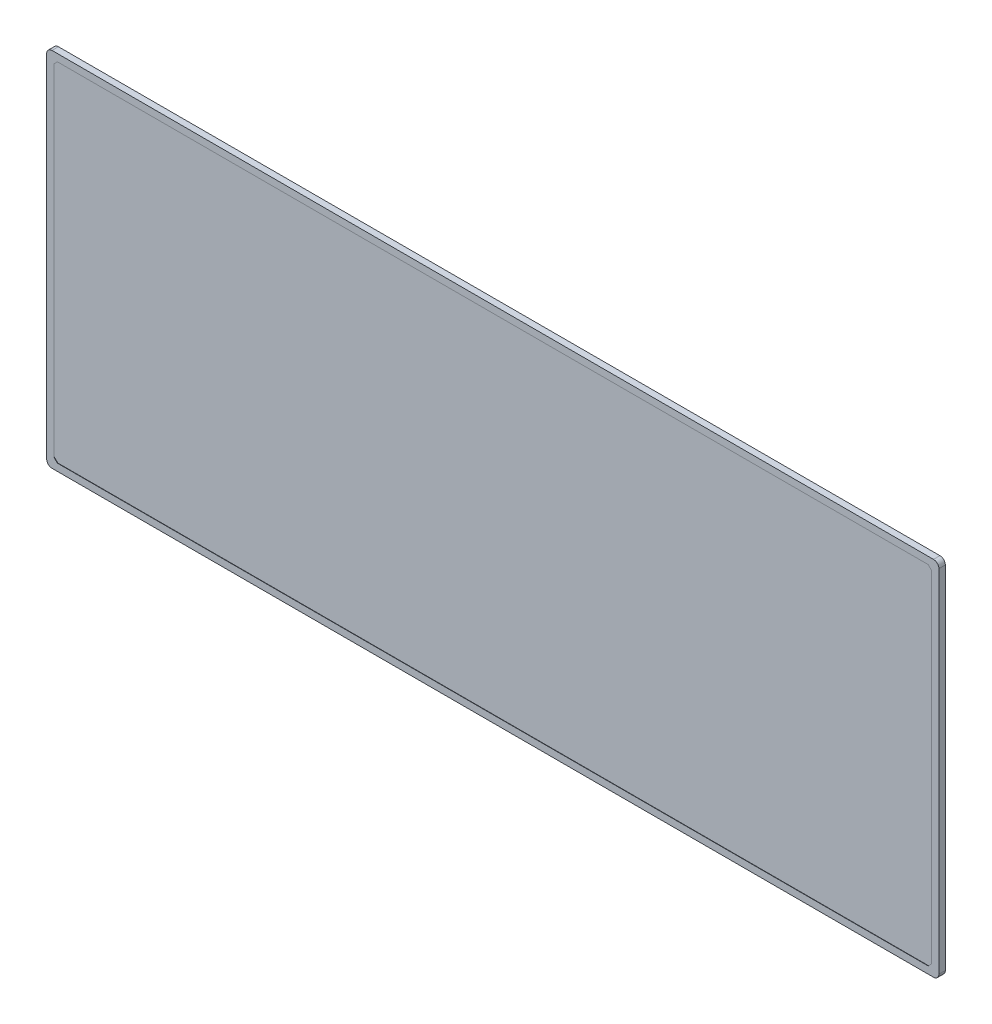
ISO-10303-21;
HEADER;
FILE_DESCRIPTION(('STEP AP214'),'2;1');
FILE_NAME('part.step','',(''),(''),'','','');
FILE_SCHEMA(('AUTOMOTIVE_DESIGN { 1 0 10303 214 1 1 1 1 }'));
ENDSEC;
DATA;
#1=APPLICATION_CONTEXT('core data for automotive mechanical design processes');
#2=APPLICATION_PROTOCOL_DEFINITION('international standard','automotive_design',2000,#1);
#3=PRODUCT_CONTEXT('',#1,'mechanical');
#4=PRODUCT('Part','Part','',(#3));
#5=PRODUCT_RELATED_PRODUCT_CATEGORY('part','',(#4));
#6=PRODUCT_DEFINITION_FORMATION('','',#4);
#7=PRODUCT_DEFINITION_CONTEXT('part definition',#1,'design');
#8=PRODUCT_DEFINITION('design','',#6,#7);
#9=PRODUCT_DEFINITION_SHAPE('','',#8);
#10=(LENGTH_UNIT() NAMED_UNIT(*) SI_UNIT(.MILLI.,.METRE.));
#11=(NAMED_UNIT(*) PLANE_ANGLE_UNIT() SI_UNIT($,.RADIAN.));
#12=(NAMED_UNIT(*) SI_UNIT($,.STERADIAN.) SOLID_ANGLE_UNIT());
#13=UNCERTAINTY_MEASURE_WITH_UNIT(LENGTH_MEASURE(1.E-05),#10,'distance_accuracy_value','');
#14=(GEOMETRIC_REPRESENTATION_CONTEXT(3) GLOBAL_UNCERTAINTY_ASSIGNED_CONTEXT((#13)) GLOBAL_UNIT_ASSIGNED_CONTEXT((#10,
#11,#12)) REPRESENTATION_CONTEXT('',''));
#15=CARTESIAN_POINT('',(0.,0.,0.));
#16=DIRECTION('',(0.,0.,1.));
#17=DIRECTION('',(1.,0.,0.));
#18=AXIS2_PLACEMENT_3D('',#15,#16,#17);
#19=CARTESIAN_POINT('',(0.,0.,17.));
#20=DIRECTION('',(0.,0.,-1.));
#21=DIRECTION('',(-1.,0.,0.));
#22=AXIS2_PLACEMENT_3D('',#19,#20,#21);
#23=PLANE('',#22);
#24=DIRECTION('',(0.,1.,0.));
#25=VECTOR('',#24,1.);
#26=CARTESIAN_POINT('',(1227.5,-486.,17.));
#27=LINE('',#26,#25);
#28=CARTESIAN_POINT('',(1227.5,-476.,17.));
#29=VERTEX_POINT('',#28);
#30=CARTESIAN_POINT('',(1227.5,476.,17.));
#31=VERTEX_POINT('',#30);
#32=EDGE_CURVE('E264',#29,#31,#27,.T.);
#33=ORIENTED_EDGE('',*,*,#32,.T.);
#34=DIRECTION('',(0.70710678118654,-0.707106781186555,0.));
#35=VECTOR('',#34,1.);
#36=CARTESIAN_POINT('',(1227.5,476.,17.));
#37=LINE('',#36,#35);
#38=CARTESIAN_POINT('',(1217.5,486.,17.));
#39=VERTEX_POINT('',#38);
#40=EDGE_CURVE('E219',#31,#39,#37,.F.);
#41=ORIENTED_EDGE('',*,*,#40,.T.);
#42=DIRECTION('',(-1.,0.,0.));
#43=VECTOR('',#42,1.);
#44=CARTESIAN_POINT('',(-1227.5,486.,17.));
#45=LINE('',#44,#43);
#46=CARTESIAN_POINT('',(-1217.5,486.,17.));
#47=VERTEX_POINT('',#46);
#48=EDGE_CURVE('E269',#39,#47,#45,.T.);
#49=ORIENTED_EDGE('',*,*,#48,.T.);
#50=DIRECTION('',(0.707106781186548,0.707106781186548,0.));
#51=VECTOR('',#50,1.);
#52=CARTESIAN_POINT('',(-1217.5,486.,17.));
#53=LINE('',#52,#51);
#54=CARTESIAN_POINT('',(-1227.5,476.,17.));
#55=VERTEX_POINT('',#54);
#56=EDGE_CURVE('E217',#47,#55,#53,.F.);
#57=ORIENTED_EDGE('',*,*,#56,.T.);
#58=DIRECTION('',(0.,-1.,0.));
#59=VECTOR('',#58,1.);
#60=CARTESIAN_POINT('',(-1227.5,-486.,17.));
#61=LINE('',#60,#59);
#62=CARTESIAN_POINT('',(-1227.5,-476.,17.));
#63=VERTEX_POINT('',#62);
#64=EDGE_CURVE('E180',#55,#63,#61,.T.);
#65=ORIENTED_EDGE('',*,*,#64,.T.);
#66=DIRECTION('',(-0.70710678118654,0.707106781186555,0.));
#67=VECTOR('',#66,1.);
#68=CARTESIAN_POINT('',(-1227.5,-476.,17.));
#69=LINE('',#68,#67);
#70=CARTESIAN_POINT('',(-1217.5,-486.,17.));
#71=VERTEX_POINT('',#70);
#72=EDGE_CURVE('E215',#63,#71,#69,.F.);
#73=ORIENTED_EDGE('',*,*,#72,.T.);
#74=DIRECTION('',(1.,0.,0.));
#75=VECTOR('',#74,1.);
#76=CARTESIAN_POINT('',(-1227.5,-486.,17.));
#77=LINE('',#76,#75);
#78=CARTESIAN_POINT('',(1217.5,-486.,17.));
#79=VERTEX_POINT('',#78);
#80=EDGE_CURVE('E175',#71,#79,#77,.T.);
#81=ORIENTED_EDGE('',*,*,#80,.T.);
#82=DIRECTION('',(-0.707106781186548,-0.707106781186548,0.));
#83=VECTOR('',#82,1.);
#84=CARTESIAN_POINT('',(1217.5,-486.,17.));
#85=LINE('',#84,#83);
#86=EDGE_CURVE('E213',#79,#29,#85,.F.);
#87=ORIENTED_EDGE('',*,*,#86,.T.);
#88=EDGE_LOOP('',(#33,#41,#49,#57,#65,#73,#81,#87));
#89=FACE_BOUND('',#88,.T.);
#90=ADVANCED_FACE('F35',(#89),#23,.F.);
#91=CARTESIAN_POINT('',(1227.5,-486.,18.));
#92=DIRECTION('',(0.,-1.,0.));
#93=DIRECTION('',(0.,0.,-1.));
#94=AXIS2_PLACEMENT_3D('',#91,#92,#93);
#95=PLANE('',#94);
#96=ORIENTED_EDGE('',*,*,#80,.F.);
#97=DIRECTION('',(0.,0.,1.));
#98=VECTOR('',#97,1.);
#99=CARTESIAN_POINT('',(-1217.5,-486.,18.));
#100=LINE('',#99,#98);
#101=CARTESIAN_POINT('',(-1217.5,-486.,18.));
#102=VERTEX_POINT('',#101);
#103=EDGE_CURVE('E50',#71,#102,#100,.T.);
#104=ORIENTED_EDGE('',*,*,#103,.T.);
#105=DIRECTION('',(-1.,0.,0.));
#106=VECTOR('',#105,1.);
#107=CARTESIAN_POINT('',(1227.5,-486.,18.));
#108=LINE('',#107,#106);
#109=CARTESIAN_POINT('',(1217.5,-486.,18.));
#110=VERTEX_POINT('',#109);
#111=EDGE_CURVE('E246',#110,#102,#108,.T.);
#112=ORIENTED_EDGE('',*,*,#111,.F.);
#113=DIRECTION('',(0.,0.,-1.));
#114=VECTOR('',#113,1.);
#115=CARTESIAN_POINT('',(1217.5,-486.,17.));
#116=LINE('',#115,#114);
#117=EDGE_CURVE('E231',#110,#79,#116,.T.);
#118=ORIENTED_EDGE('',*,*,#117,.T.);
#119=EDGE_LOOP('',(#96,#104,#112,#118));
#120=FACE_BOUND('',#119,.T.);
#121=ADVANCED_FACE('F259',(#120),#95,.F.);
#122=CARTESIAN_POINT('',(1227.5,486.,18.));
#123=DIRECTION('',(1.,0.,0.));
#124=DIRECTION('',(0.,0.,-1.));
#125=AXIS2_PLACEMENT_3D('',#122,#123,#124);
#126=PLANE('',#125);
#127=DIRECTION('',(0.,-1.,0.));
#128=VECTOR('',#127,1.);
#129=CARTESIAN_POINT('',(1227.5,486.,18.));
#130=LINE('',#129,#128);
#131=CARTESIAN_POINT('',(1227.5,476.,18.));
#132=VERTEX_POINT('',#131);
#133=CARTESIAN_POINT('',(1227.5,-476.,18.));
#134=VERTEX_POINT('',#133);
#135=EDGE_CURVE('E170',#132,#134,#130,.T.);
#136=ORIENTED_EDGE('',*,*,#135,.F.);
#137=DIRECTION('',(0.,0.,-1.));
#138=VECTOR('',#137,1.);
#139=CARTESIAN_POINT('',(1227.5,476.,17.));
#140=LINE('',#139,#138);
#141=EDGE_CURVE('E210',#132,#31,#140,.T.);
#142=ORIENTED_EDGE('',*,*,#141,.T.);
#143=ORIENTED_EDGE('',*,*,#32,.F.);
#144=DIRECTION('',(0.,0.,1.));
#145=VECTOR('',#144,1.);
#146=CARTESIAN_POINT('',(1227.5,-476.,18.));
#147=LINE('',#146,#145);
#148=EDGE_CURVE('E208',#29,#134,#147,.T.);
#149=ORIENTED_EDGE('',*,*,#148,.T.);
#150=EDGE_LOOP('',(#136,#142,#143,#149));
#151=FACE_BOUND('',#150,.T.);
#152=ADVANCED_FACE('F267',(#151),#126,.F.);
#153=CARTESIAN_POINT('',(-1227.5,486.,18.));
#154=DIRECTION('',(0.,1.,0.));
#155=DIRECTION('',(0.,0.,1.));
#156=AXIS2_PLACEMENT_3D('',#153,#154,#155);
#157=PLANE('',#156);
#158=ORIENTED_EDGE('',*,*,#48,.F.);
#159=DIRECTION('',(0.,0.,1.));
#160=VECTOR('',#159,1.);
#161=CARTESIAN_POINT('',(1217.5,486.,18.));
#162=LINE('',#161,#160);
#163=CARTESIAN_POINT('',(1217.5,486.,18.));
#164=VERTEX_POINT('',#163);
#165=EDGE_CURVE('E224',#39,#164,#162,.T.);
#166=ORIENTED_EDGE('',*,*,#165,.T.);
#167=DIRECTION('',(1.,0.,0.));
#168=VECTOR('',#167,1.);
#169=CARTESIAN_POINT('',(-1227.5,486.,18.));
#170=LINE('',#169,#168);
#171=CARTESIAN_POINT('',(-1217.5,486.,18.));
#172=VERTEX_POINT('',#171);
#173=EDGE_CURVE('E254',#172,#164,#170,.T.);
#174=ORIENTED_EDGE('',*,*,#173,.F.);
#175=DIRECTION('',(0.,0.,-1.));
#176=VECTOR('',#175,1.);
#177=CARTESIAN_POINT('',(-1217.5,486.,17.));
#178=LINE('',#177,#176);
#179=EDGE_CURVE('E221',#172,#47,#178,.T.);
#180=ORIENTED_EDGE('',*,*,#179,.T.);
#181=EDGE_LOOP('',(#158,#166,#174,#180));
#182=FACE_BOUND('',#181,.T.);
#183=ADVANCED_FACE('F301',(#182),#157,.F.);
#184=CARTESIAN_POINT('',(-1227.5,-486.,18.));
#185=DIRECTION('',(-1.,0.,0.));
#186=DIRECTION('',(0.,0.,1.));
#187=AXIS2_PLACEMENT_3D('',#184,#185,#186);
#188=PLANE('',#187);
#189=ORIENTED_EDGE('',*,*,#64,.F.);
#190=DIRECTION('',(0.,0.,1.));
#191=VECTOR('',#190,1.);
#192=CARTESIAN_POINT('',(-1227.5,476.,18.));
#193=LINE('',#192,#191);
#194=CARTESIAN_POINT('',(-1227.5,476.,18.));
#195=VERTEX_POINT('',#194);
#196=EDGE_CURVE('E229',#55,#195,#193,.T.);
#197=ORIENTED_EDGE('',*,*,#196,.T.);
#198=DIRECTION('',(0.,1.,0.));
#199=VECTOR('',#198,1.);
#200=CARTESIAN_POINT('',(-1227.5,-486.,18.));
#201=LINE('',#200,#199);
#202=CARTESIAN_POINT('',(-1227.5,-476.,18.));
#203=VERTEX_POINT('',#202);
#204=EDGE_CURVE('E244',#203,#195,#201,.T.);
#205=ORIENTED_EDGE('',*,*,#204,.F.);
#206=DIRECTION('',(0.,0.,-1.));
#207=VECTOR('',#206,1.);
#208=CARTESIAN_POINT('',(-1227.5,-476.,17.));
#209=LINE('',#208,#207);
#210=EDGE_CURVE('E226',#203,#63,#209,.T.);
#211=ORIENTED_EDGE('',*,*,#210,.T.);
#212=EDGE_LOOP('',(#189,#197,#205,#211));
#213=FACE_BOUND('',#212,.T.);
#214=ADVANCED_FACE('F251',(#213),#188,.F.);
#215=CARTESIAN_POINT('',(-1247.5,-506.,18.));
#216=DIRECTION('',(-1.,0.,0.));
#217=DIRECTION('',(0.,0.,1.));
#218=AXIS2_PLACEMENT_3D('',#215,#216,#217);
#219=PLANE('',#218);
#220=DIRECTION('',(0.,1.,0.));
#221=VECTOR('',#220,1.);
#222=CARTESIAN_POINT('',(-1247.5,-506.,18.));
#223=LINE('',#222,#221);
#224=CARTESIAN_POINT('',(-1247.5,-491.,18.));
#225=VERTEX_POINT('',#224);
#226=CARTESIAN_POINT('',(-1247.5,491.,18.));
#227=VERTEX_POINT('',#226);
#228=EDGE_CURVE('E279',#225,#227,#223,.T.);
#229=ORIENTED_EDGE('',*,*,#228,.T.);
#230=DIRECTION('',(0.,0.,-1.));
#231=VECTOR('',#230,1.);
#232=CARTESIAN_POINT('',(-1247.5,491.,18.));
#233=LINE('',#232,#231);
#234=CARTESIAN_POINT('',(-1247.5,491.,0.));
#235=VERTEX_POINT('',#234);
#236=EDGE_CURVE('E168',#227,#235,#233,.T.);
#237=ORIENTED_EDGE('',*,*,#236,.T.);
#238=DIRECTION('',(0.,1.,0.));
#239=VECTOR('',#238,1.);
#240=CARTESIAN_POINT('',(-1247.5,-506.,0.));
#241=LINE('',#240,#239);
#242=CARTESIAN_POINT('',(-1247.5,-491.,0.));
#243=VERTEX_POINT('',#242);
#244=EDGE_CURVE('E151',#243,#235,#241,.T.);
#245=ORIENTED_EDGE('',*,*,#244,.F.);
#246=DIRECTION('',(0.,0.,-1.));
#247=VECTOR('',#246,1.);
#248=CARTESIAN_POINT('',(-1247.5,-491.,18.));
#249=LINE('',#248,#247);
#250=EDGE_CURVE('E165',#243,#225,#249,.F.);
#251=ORIENTED_EDGE('',*,*,#250,.T.);
#252=EDGE_LOOP('',(#229,#237,#245,#251));
#253=FACE_BOUND('',#252,.T.);
#254=ADVANCED_FACE('F164',(#253),#219,.T.);
#255=CARTESIAN_POINT('',(1247.5,-506.,18.));
#256=DIRECTION('',(0.,-1.,0.));
#257=DIRECTION('',(1.,0.,0.));
#258=AXIS2_PLACEMENT_3D('',#255,#256,#257);
#259=PLANE('',#258);
#260=DIRECTION('',(-1.,0.,0.));
#261=VECTOR('',#260,1.);
#262=CARTESIAN_POINT('',(1247.5,-506.,18.));
#263=LINE('',#262,#261);
#264=CARTESIAN_POINT('',(1232.5,-506.,18.));
#265=VERTEX_POINT('',#264);
#266=CARTESIAN_POINT('',(-1232.5,-506.,18.));
#267=VERTEX_POINT('',#266);
#268=EDGE_CURVE('E270',#265,#267,#263,.T.);
#269=ORIENTED_EDGE('',*,*,#268,.T.);
#270=DIRECTION('',(0.,0.,-1.));
#271=VECTOR('',#270,1.);
#272=CARTESIAN_POINT('',(-1232.5,-506.,18.));
#273=LINE('',#272,#271);
#274=CARTESIAN_POINT('',(-1232.5,-506.,0.));
#275=VERTEX_POINT('',#274);
#276=EDGE_CURVE('E201',#267,#275,#273,.T.);
#277=ORIENTED_EDGE('',*,*,#276,.T.);
#278=DIRECTION('',(-1.,0.,0.));
#279=VECTOR('',#278,1.);
#280=CARTESIAN_POINT('',(1247.5,-506.,0.));
#281=LINE('',#280,#279);
#282=CARTESIAN_POINT('',(1232.5,-506.,0.));
#283=VERTEX_POINT('',#282);
#284=EDGE_CURVE('E153',#283,#275,#281,.T.);
#285=ORIENTED_EDGE('',*,*,#284,.F.);
#286=DIRECTION('',(0.,0.,-1.));
#287=VECTOR('',#286,1.);
#288=CARTESIAN_POINT('',(1232.5,-506.,18.));
#289=LINE('',#288,#287);
#290=EDGE_CURVE('E199',#283,#265,#289,.F.);
#291=ORIENTED_EDGE('',*,*,#290,.T.);
#292=EDGE_LOOP('',(#269,#277,#285,#291));
#293=FACE_BOUND('',#292,.T.);
#294=ADVANCED_FACE('F350',(#293),#259,.T.);
#295=CARTESIAN_POINT('',(1247.5,506.,18.));
#296=DIRECTION('',(1.,0.,0.));
#297=DIRECTION('',(0.,1.,0.));
#298=AXIS2_PLACEMENT_3D('',#295,#296,#297);
#299=PLANE('',#298);
#300=DIRECTION('',(0.,-1.,0.));
#301=VECTOR('',#300,1.);
#302=CARTESIAN_POINT('',(1247.5,506.,18.));
#303=LINE('',#302,#301);
#304=CARTESIAN_POINT('',(1247.5,491.,18.));
#305=VERTEX_POINT('',#304);
#306=CARTESIAN_POINT('',(1247.5,-491.,18.));
#307=VERTEX_POINT('',#306);
#308=EDGE_CURVE('E275',#305,#307,#303,.T.);
#309=ORIENTED_EDGE('',*,*,#308,.T.);
#310=DIRECTION('',(0.,0.,-1.));
#311=VECTOR('',#310,1.);
#312=CARTESIAN_POINT('',(1247.5,-491.,18.));
#313=LINE('',#312,#311);
#314=CARTESIAN_POINT('',(1247.5,-491.,0.));
#315=VERTEX_POINT('',#314);
#316=EDGE_CURVE('E205',#307,#315,#313,.T.);
#317=ORIENTED_EDGE('',*,*,#316,.T.);
#318=DIRECTION('',(0.,-1.,0.));
#319=VECTOR('',#318,1.);
#320=CARTESIAN_POINT('',(1247.5,506.,0.));
#321=LINE('',#320,#319);
#322=CARTESIAN_POINT('',(1247.5,491.,0.));
#323=VERTEX_POINT('',#322);
#324=EDGE_CURVE('E280',#323,#315,#321,.T.);
#325=ORIENTED_EDGE('',*,*,#324,.F.);
#326=DIRECTION('',(0.,0.,-1.));
#327=VECTOR('',#326,1.);
#328=CARTESIAN_POINT('',(1247.5,491.,18.));
#329=LINE('',#328,#327);
#330=EDGE_CURVE('E203',#323,#305,#329,.F.);
#331=ORIENTED_EDGE('',*,*,#330,.T.);
#332=EDGE_LOOP('',(#309,#317,#325,#331));
#333=FACE_BOUND('',#332,.T.);
#334=ADVANCED_FACE('F354',(#333),#299,.T.);
#335=CARTESIAN_POINT('',(-1247.5,506.,18.));
#336=DIRECTION('',(0.,1.,0.));
#337=DIRECTION('',(-1.,0.,0.));
#338=AXIS2_PLACEMENT_3D('',#335,#336,#337);
#339=PLANE('',#338);
#340=DIRECTION('',(1.,0.,0.));
#341=VECTOR('',#340,1.);
#342=CARTESIAN_POINT('',(-1247.5,506.,0.));
#343=LINE('',#342,#341);
#344=CARTESIAN_POINT('',(-1232.5,506.,0.));
#345=VERTEX_POINT('',#344);
#346=CARTESIAN_POINT('',(1232.5,506.,0.));
#347=VERTEX_POINT('',#346);
#348=EDGE_CURVE('E169',#345,#347,#343,.T.);
#349=ORIENTED_EDGE('',*,*,#348,.F.);
#350=DIRECTION('',(0.,0.,-1.));
#351=VECTOR('',#350,1.);
#352=CARTESIAN_POINT('',(-1232.5,506.,18.));
#353=LINE('',#352,#351);
#354=CARTESIAN_POINT('',(-1232.5,506.,18.));
#355=VERTEX_POINT('',#354);
#356=EDGE_CURVE('E190',#345,#355,#353,.F.);
#357=ORIENTED_EDGE('',*,*,#356,.T.);
#358=DIRECTION('',(1.,0.,0.));
#359=VECTOR('',#358,1.);
#360=CARTESIAN_POINT('',(-1247.5,506.,18.));
#361=LINE('',#360,#359);
#362=CARTESIAN_POINT('',(1232.5,506.,18.));
#363=VERTEX_POINT('',#362);
#364=EDGE_CURVE('E287',#355,#363,#361,.T.);
#365=ORIENTED_EDGE('',*,*,#364,.T.);
#366=DIRECTION('',(0.,0.,-1.));
#367=VECTOR('',#366,1.);
#368=CARTESIAN_POINT('',(1232.5,506.,18.));
#369=LINE('',#368,#367);
#370=EDGE_CURVE('E187',#363,#347,#369,.T.);
#371=ORIENTED_EDGE('',*,*,#370,.T.);
#372=EDGE_LOOP('',(#349,#357,#365,#371));
#373=FACE_BOUND('',#372,.T.);
#374=ADVANCED_FACE('F345',(#373),#339,.T.);
#375=CARTESIAN_POINT('',(0.,0.,18.));
#376=DIRECTION('',(0.,0.,-1.));
#377=DIRECTION('',(-1.,0.,0.));
#378=AXIS2_PLACEMENT_3D('',#375,#376,#377);
#379=PLANE('',#378);
#380=ORIENTED_EDGE('',*,*,#173,.T.);
#381=DIRECTION('',(-0.70710678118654,0.707106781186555,0.));
#382=VECTOR('',#381,1.);
#383=CARTESIAN_POINT('',(851.750000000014,851.749999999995,18.));
#384=LINE('',#383,#382);
#385=EDGE_CURVE('E235',#164,#132,#384,.F.);
#386=ORIENTED_EDGE('',*,*,#385,.T.);
#387=ORIENTED_EDGE('',*,*,#135,.T.);
#388=DIRECTION('',(0.707106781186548,0.707106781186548,0.));
#389=VECTOR('',#388,1.);
#390=CARTESIAN_POINT('',(851.75,-851.75,18.));
#391=LINE('',#390,#389);
#392=EDGE_CURVE('E11',#134,#110,#391,.F.);
#393=ORIENTED_EDGE('',*,*,#392,.T.);
#394=ORIENTED_EDGE('',*,*,#111,.T.);
#395=DIRECTION('',(0.70710678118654,-0.707106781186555,0.));
#396=VECTOR('',#395,1.);
#397=CARTESIAN_POINT('',(-851.750000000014,-851.749999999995,18.));
#398=LINE('',#397,#396);
#399=EDGE_CURVE('E43',#102,#203,#398,.F.);
#400=ORIENTED_EDGE('',*,*,#399,.T.);
#401=ORIENTED_EDGE('',*,*,#204,.T.);
#402=DIRECTION('',(-0.707106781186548,-0.707106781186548,0.));
#403=VECTOR('',#402,1.);
#404=CARTESIAN_POINT('',(-851.75,851.75,18.));
#405=LINE('',#404,#403);
#406=EDGE_CURVE('E237',#195,#172,#405,.F.);
#407=ORIENTED_EDGE('',*,*,#406,.T.);
#408=EDGE_LOOP('',(#380,#386,#387,#393,#394,#400,#401,#407));
#409=FACE_BOUND('',#408,.T.);
#410=ORIENTED_EDGE('',*,*,#364,.F.);
#411=CARTESIAN_POINT('',(-1232.5,491.,18.));
#412=DIRECTION('',(0.,0.,-1.));
#413=DIRECTION('',(-1.,0.,0.));
#414=AXIS2_PLACEMENT_3D('',#411,#412,#413);
#415=CIRCLE('',#414,15.);
#416=EDGE_CURVE('E197',#355,#227,#415,.F.);
#417=ORIENTED_EDGE('',*,*,#416,.T.);
#418=ORIENTED_EDGE('',*,*,#228,.F.);
#419=CARTESIAN_POINT('',(-1232.5,-491.,18.));
#420=DIRECTION('',(0.,0.,-1.));
#421=DIRECTION('',(-1.,0.,0.));
#422=AXIS2_PLACEMENT_3D('',#419,#420,#421);
#423=CIRCLE('',#422,15.);
#424=EDGE_CURVE('E174',#225,#267,#423,.F.);
#425=ORIENTED_EDGE('',*,*,#424,.T.);
#426=ORIENTED_EDGE('',*,*,#268,.F.);
#427=CARTESIAN_POINT('',(1232.5,-491.,18.));
#428=DIRECTION('',(0.,0.,-1.));
#429=DIRECTION('',(-1.,0.,0.));
#430=AXIS2_PLACEMENT_3D('',#427,#428,#429);
#431=CIRCLE('',#430,15.);
#432=EDGE_CURVE('E194',#265,#307,#431,.F.);
#433=ORIENTED_EDGE('',*,*,#432,.T.);
#434=ORIENTED_EDGE('',*,*,#308,.F.);
#435=CARTESIAN_POINT('',(1232.5,491.,18.));
#436=DIRECTION('',(0.,0.,-1.));
#437=DIRECTION('',(-1.,0.,0.));
#438=AXIS2_PLACEMENT_3D('',#435,#436,#437);
#439=CIRCLE('',#438,15.);
#440=EDGE_CURVE('E192',#305,#363,#439,.F.);
#441=ORIENTED_EDGE('',*,*,#440,.T.);
#442=EDGE_LOOP('',(#410,#417,#418,#425,#426,#433,#434,#441));
#443=FACE_BOUND('',#442,.T.);
#444=ADVANCED_FACE('F242',(#409,#443),#379,.F.);
#445=CARTESIAN_POINT('',(0.,0.,0.));
#446=DIRECTION('',(0.,0.,-1.));
#447=DIRECTION('',(-1.,0.,0.));
#448=AXIS2_PLACEMENT_3D('',#445,#446,#447);
#449=PLANE('',#448);
#450=ORIENTED_EDGE('',*,*,#244,.T.);
#451=CARTESIAN_POINT('',(-1232.5,491.,0.));
#452=DIRECTION('',(0.,0.,-1.));
#453=DIRECTION('',(-1.,0.,0.));
#454=AXIS2_PLACEMENT_3D('',#451,#452,#453);
#455=CIRCLE('',#454,15.);
#456=EDGE_CURVE('E158',#235,#345,#455,.T.);
#457=ORIENTED_EDGE('',*,*,#456,.T.);
#458=ORIENTED_EDGE('',*,*,#348,.T.);
#459=CARTESIAN_POINT('',(1232.5,491.,0.));
#460=DIRECTION('',(0.,0.,-1.));
#461=DIRECTION('',(-1.,0.,0.));
#462=AXIS2_PLACEMENT_3D('',#459,#460,#461);
#463=CIRCLE('',#462,15.);
#464=EDGE_CURVE('E177',#347,#323,#463,.T.);
#465=ORIENTED_EDGE('',*,*,#464,.T.);
#466=ORIENTED_EDGE('',*,*,#324,.T.);
#467=CARTESIAN_POINT('',(1232.5,-491.,0.));
#468=DIRECTION('',(0.,0.,-1.));
#469=DIRECTION('',(-1.,0.,0.));
#470=AXIS2_PLACEMENT_3D('',#467,#468,#469);
#471=CIRCLE('',#470,15.);
#472=EDGE_CURVE('E159',#315,#283,#471,.T.);
#473=ORIENTED_EDGE('',*,*,#472,.T.);
#474=ORIENTED_EDGE('',*,*,#284,.T.);
#475=CARTESIAN_POINT('',(-1232.5,-491.,0.));
#476=DIRECTION('',(0.,0.,-1.));
#477=DIRECTION('',(-1.,0.,0.));
#478=AXIS2_PLACEMENT_3D('',#475,#476,#477);
#479=CIRCLE('',#478,15.);
#480=EDGE_CURVE('E148',#275,#243,#479,.T.);
#481=ORIENTED_EDGE('',*,*,#480,.T.);
#482=EDGE_LOOP('',(#450,#457,#458,#465,#466,#473,#474,#481));
#483=FACE_BOUND('',#482,.T.);
#484=ADVANCED_FACE('F150',(#483),#449,.T.);
#485=CARTESIAN_POINT('',(-1232.5,491.,18.));
#486=DIRECTION('',(0.,0.,-1.));
#487=DIRECTION('',(-1.,0.,0.));
#488=AXIS2_PLACEMENT_3D('',#485,#486,#487);
#489=CYLINDRICAL_SURFACE('',#488,15.);
#490=ORIENTED_EDGE('',*,*,#416,.F.);
#491=ORIENTED_EDGE('',*,*,#356,.F.);
#492=ORIENTED_EDGE('',*,*,#456,.F.);
#493=ORIENTED_EDGE('',*,*,#236,.F.);
#494=EDGE_LOOP('',(#490,#491,#492,#493));
#495=FACE_BOUND('',#494,.T.);
#496=ADVANCED_FACE('F323',(#495),#489,.T.);
#497=CARTESIAN_POINT('',(-1232.5,-491.,18.));
#498=DIRECTION('',(0.,0.,-1.));
#499=DIRECTION('',(-1.,0.,0.));
#500=AXIS2_PLACEMENT_3D('',#497,#498,#499);
#501=CYLINDRICAL_SURFACE('',#500,15.);
#502=ORIENTED_EDGE('',*,*,#424,.F.);
#503=ORIENTED_EDGE('',*,*,#250,.F.);
#504=ORIENTED_EDGE('',*,*,#480,.F.);
#505=ORIENTED_EDGE('',*,*,#276,.F.);
#506=EDGE_LOOP('',(#502,#503,#504,#505));
#507=FACE_BOUND('',#506,.T.);
#508=ADVANCED_FACE('F173',(#507),#501,.T.);
#509=CARTESIAN_POINT('',(1232.5,-491.,18.));
#510=DIRECTION('',(0.,0.,-1.));
#511=DIRECTION('',(-1.,0.,0.));
#512=AXIS2_PLACEMENT_3D('',#509,#510,#511);
#513=CYLINDRICAL_SURFACE('',#512,15.);
#514=ORIENTED_EDGE('',*,*,#432,.F.);
#515=ORIENTED_EDGE('',*,*,#290,.F.);
#516=ORIENTED_EDGE('',*,*,#472,.F.);
#517=ORIENTED_EDGE('',*,*,#316,.F.);
#518=EDGE_LOOP('',(#514,#515,#516,#517));
#519=FACE_BOUND('',#518,.T.);
#520=ADVANCED_FACE('F329',(#519),#513,.T.);
#521=CARTESIAN_POINT('',(1232.5,491.,18.));
#522=DIRECTION('',(0.,0.,-1.));
#523=DIRECTION('',(-1.,0.,0.));
#524=AXIS2_PLACEMENT_3D('',#521,#522,#523);
#525=CYLINDRICAL_SURFACE('',#524,15.);
#526=ORIENTED_EDGE('',*,*,#440,.F.);
#527=ORIENTED_EDGE('',*,*,#330,.F.);
#528=ORIENTED_EDGE('',*,*,#464,.F.);
#529=ORIENTED_EDGE('',*,*,#370,.F.);
#530=EDGE_LOOP('',(#526,#527,#528,#529));
#531=FACE_BOUND('',#530,.T.);
#532=ADVANCED_FACE('F310',(#531),#525,.T.);
#533=CARTESIAN_POINT('',(1227.5,476.,18.));
#534=DIRECTION('',(-0.707106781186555,-0.70710678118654,0.));
#535=DIRECTION('',(0.,0.,1.));
#536=AXIS2_PLACEMENT_3D('',#533,#534,#535);
#537=PLANE('',#536);
#538=ORIENTED_EDGE('',*,*,#385,.F.);
#539=ORIENTED_EDGE('',*,*,#165,.F.);
#540=ORIENTED_EDGE('',*,*,#40,.F.);
#541=ORIENTED_EDGE('',*,*,#141,.F.);
#542=EDGE_LOOP('',(#538,#539,#540,#541));
#543=FACE_BOUND('',#542,.T.);
#544=ADVANCED_FACE('F299',(#543),#537,.T.);
#545=CARTESIAN_POINT('',(-1217.5,486.,18.));
#546=DIRECTION('',(0.707106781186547,-0.707106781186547,0.));
#547=DIRECTION('',(0.,0.,1.));
#548=AXIS2_PLACEMENT_3D('',#545,#546,#547);
#549=PLANE('',#548);
#550=ORIENTED_EDGE('',*,*,#406,.F.);
#551=ORIENTED_EDGE('',*,*,#196,.F.);
#552=ORIENTED_EDGE('',*,*,#56,.F.);
#553=ORIENTED_EDGE('',*,*,#179,.F.);
#554=EDGE_LOOP('',(#550,#551,#552,#553));
#555=FACE_BOUND('',#554,.T.);
#556=ADVANCED_FACE('F303',(#555),#549,.T.);
#557=CARTESIAN_POINT('',(-1227.5,-476.,18.));
#558=DIRECTION('',(0.707106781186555,0.70710678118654,0.));
#559=DIRECTION('',(0.,0.,1.));
#560=AXIS2_PLACEMENT_3D('',#557,#558,#559);
#561=PLANE('',#560);
#562=ORIENTED_EDGE('',*,*,#399,.F.);
#563=ORIENTED_EDGE('',*,*,#103,.F.);
#564=ORIENTED_EDGE('',*,*,#72,.F.);
#565=ORIENTED_EDGE('',*,*,#210,.F.);
#566=EDGE_LOOP('',(#562,#563,#564,#565));
#567=FACE_BOUND('',#566,.T.);
#568=ADVANCED_FACE('F256',(#567),#561,.T.);
#569=CARTESIAN_POINT('',(1217.5,-486.,18.));
#570=DIRECTION('',(-0.707106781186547,0.707106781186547,0.));
#571=DIRECTION('',(0.,0.,1.));
#572=AXIS2_PLACEMENT_3D('',#569,#570,#571);
#573=PLANE('',#572);
#574=ORIENTED_EDGE('',*,*,#392,.F.);
#575=ORIENTED_EDGE('',*,*,#148,.F.);
#576=ORIENTED_EDGE('',*,*,#86,.F.);
#577=ORIENTED_EDGE('',*,*,#117,.F.);
#578=EDGE_LOOP('',(#574,#575,#576,#577));
#579=FACE_BOUND('',#578,.T.);
#580=ADVANCED_FACE('F37',(#579),#573,.T.);
#581=CLOSED_SHELL('',(#90,#121,#152,#183,#214,#254,#294,#334,#374,#444,#484,#496,#508,#520,#532,
#544,#556,#568,#580));
#582=MANIFOLD_SOLID_BREP('B2',#581);
#583=ADVANCED_BREP_SHAPE_REPRESENTATION('',(#18,#582),#14);
#584=SHAPE_DEFINITION_REPRESENTATION(#9,#583);
ENDSEC;
END-ISO-10303-21;
